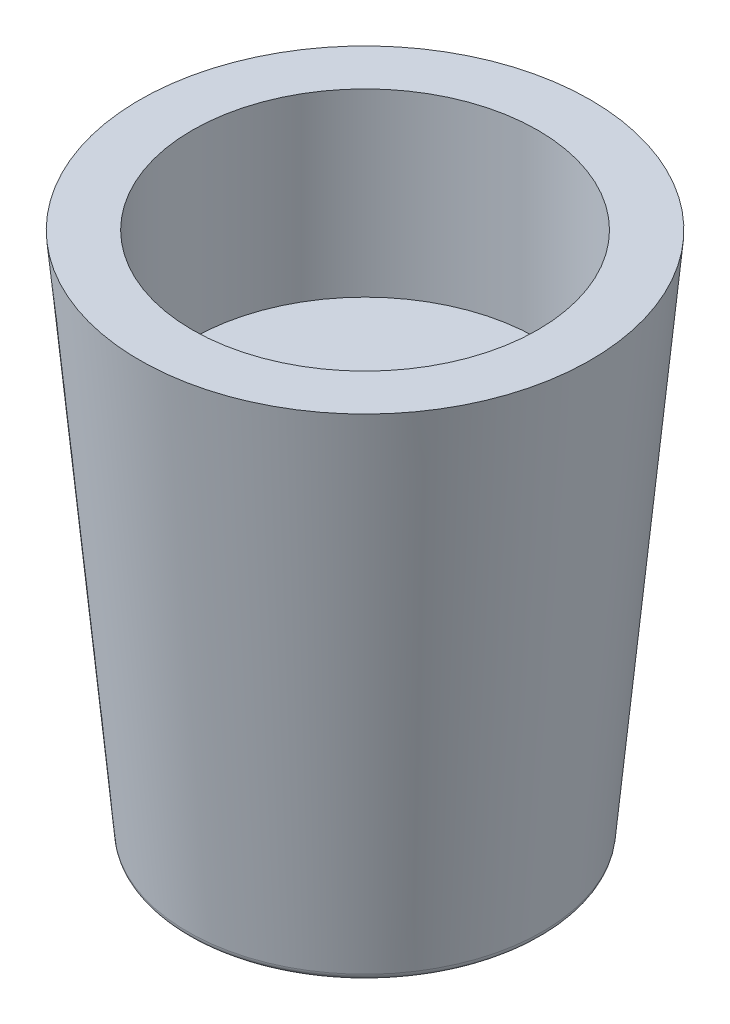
from build123d import *

# Parameters (mm, degrees)
FILLET1_R = 1


with BuildPart() as part:
    # Sketch1 → Revolve1 (revolve)
    with BuildSketch(Plane.XY, mode=Mode.PRIVATE) as revolve1_sk:
        Polygon((0, 0), (0, 46), (23, 46), (23, 70), (30, 70), (23.5, 0), align=None)
    revolve(revolve1_sk.sketch.rotate(Axis((0, 0, 0), (0, 1, 0)), 90), axis=Axis((0, 0, 0), (0, 1, 0)))

    # Fillet1
    fillet1_edges = [part.edges().sort_by_distance(p)[0] for p in [
        (0, 0, 23.5),
    ]]
    fillet(fillet1_edges, radius=FILLET1_R)


solid = part.part
